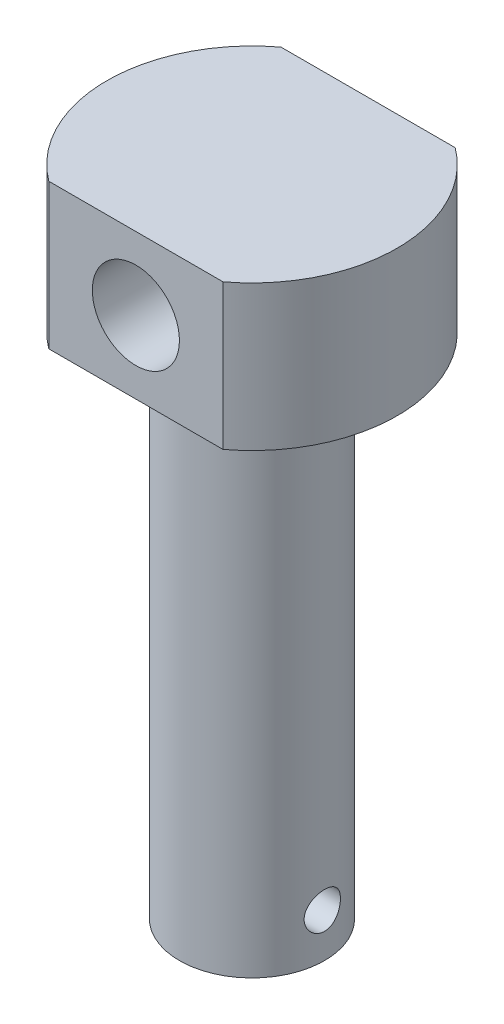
ISO-10303-21;
HEADER;
FILE_DESCRIPTION(('STEP AP214'),'2;1');
FILE_NAME('part.step','',(''),(''),'','','');
FILE_SCHEMA(('AUTOMOTIVE_DESIGN { 1 0 10303 214 1 1 1 1 }'));
ENDSEC;
DATA;
#1=APPLICATION_CONTEXT('core data for automotive mechanical design processes');
#2=APPLICATION_PROTOCOL_DEFINITION('international standard','automotive_design',2000,#1);
#3=PRODUCT_CONTEXT('',#1,'mechanical');
#4=PRODUCT('Part','Part','',(#3));
#5=PRODUCT_RELATED_PRODUCT_CATEGORY('part','',(#4));
#6=PRODUCT_DEFINITION_FORMATION('','',#4);
#7=PRODUCT_DEFINITION_CONTEXT('part definition',#1,'design');
#8=PRODUCT_DEFINITION('design','',#6,#7);
#9=PRODUCT_DEFINITION_SHAPE('','',#8);
#10=(LENGTH_UNIT() NAMED_UNIT(*) SI_UNIT(.MILLI.,.METRE.));
#11=(NAMED_UNIT(*) PLANE_ANGLE_UNIT() SI_UNIT($,.RADIAN.));
#12=(NAMED_UNIT(*) SI_UNIT($,.STERADIAN.) SOLID_ANGLE_UNIT());
#13=UNCERTAINTY_MEASURE_WITH_UNIT(LENGTH_MEASURE(1.E-05),#10,'distance_accuracy_value','');
#14=(GEOMETRIC_REPRESENTATION_CONTEXT(3) GLOBAL_UNCERTAINTY_ASSIGNED_CONTEXT((#13)) GLOBAL_UNIT_ASSIGNED_CONTEXT((#10,
#11,#12)) REPRESENTATION_CONTEXT('',''));
#15=CARTESIAN_POINT('',(0.,0.,0.));
#16=DIRECTION('',(0.,0.,1.));
#17=DIRECTION('',(1.,0.,0.));
#18=AXIS2_PLACEMENT_3D('',#15,#16,#17);
#19=CARTESIAN_POINT('',(0.,103.551163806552,0.));
#20=DIRECTION('',(0.,1.,0.));
#21=DIRECTION('',(-1.,0.,0.));
#22=AXIS2_PLACEMENT_3D('',#19,#20,#21);
#23=CYLINDRICAL_SURFACE('',#22,10.);
#24=CARTESIAN_POINT('',(0.,45.,0.));
#25=DIRECTION('',(0.,1.,0.));
#26=DIRECTION('',(-1.,0.,0.));
#27=AXIS2_PLACEMENT_3D('',#24,#25,#26);
#28=CIRCLE('',#27,10.);
#29=CARTESIAN_POINT('',(5.99999999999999,45.,8.00000000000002));
#30=VERTEX_POINT('',#29);
#31=CARTESIAN_POINT('',(5.99999999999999,45.,-8.));
#32=VERTEX_POINT('',#31);
#33=EDGE_CURVE('E123',#30,#32,#28,.T.);
#34=ORIENTED_EDGE('',*,*,#33,.F.);
#35=DIRECTION('',(0.,1.,0.));
#36=VECTOR('',#35,1.);
#37=CARTESIAN_POINT('',(5.99999999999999,0.,8.));
#38=LINE('',#37,#36);
#39=CARTESIAN_POINT('',(5.99999999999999,35.,8.));
#40=VERTEX_POINT('',#39);
#41=EDGE_CURVE('E54',#40,#30,#38,.T.);
#42=ORIENTED_EDGE('',*,*,#41,.F.);
#43=CARTESIAN_POINT('',(0.,35.,0.));
#44=DIRECTION('',(0.,1.,0.));
#45=DIRECTION('',(-1.,0.,0.));
#46=AXIS2_PLACEMENT_3D('',#43,#44,#45);
#47=CIRCLE('',#46,10.);
#48=CARTESIAN_POINT('',(5.99999999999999,35.,-8.));
#49=VERTEX_POINT('',#48);
#50=EDGE_CURVE('E127',#40,#49,#47,.T.);
#51=ORIENTED_EDGE('',*,*,#50,.T.);
#52=DIRECTION('',(0.,1.,0.));
#53=VECTOR('',#52,1.);
#54=CARTESIAN_POINT('',(5.99999999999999,0.,-8.));
#55=LINE('',#54,#53);
#56=EDGE_CURVE('E116',#49,#32,#55,.T.);
#57=ORIENTED_EDGE('',*,*,#56,.T.);
#58=EDGE_LOOP('',(#34,#42,#51,#57));
#59=FACE_BOUND('',#58,.T.);
#60=ADVANCED_FACE('F34',(#59),#23,.T.);
#61=CARTESIAN_POINT('',(0.,0.,0.));
#62=DIRECTION('',(0.,1.,0.));
#63=DIRECTION('',(-1.,0.,0.));
#64=AXIS2_PLACEMENT_3D('',#61,#62,#63);
#65=PLANE('',#64);
#66=CARTESIAN_POINT('',(0.,0.,0.));
#67=DIRECTION('',(0.,-1.,0.));
#68=DIRECTION('',(0.,0.,-1.));
#69=AXIS2_PLACEMENT_3D('',#66,#67,#68);
#70=CIRCLE('',#69,1.5);
#71=CARTESIAN_POINT('',(0.,0.,-1.5));
#72=VERTEX_POINT('',#71);
#73=EDGE_CURVE('E93',#72,#72,#70,.T.);
#74=ORIENTED_EDGE('',*,*,#73,.F.);
#75=EDGE_LOOP('',(#74));
#76=FACE_BOUND('',#75,.T.);
#77=CARTESIAN_POINT('',(0.,0.,0.));
#78=DIRECTION('',(0.,1.,0.));
#79=DIRECTION('',(-1.,0.,0.));
#80=AXIS2_PLACEMENT_3D('',#77,#78,#79);
#81=CIRCLE('',#80,5.);
#82=CARTESIAN_POINT('',(-4.99999999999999,0.,0.));
#83=VERTEX_POINT('',#82);
#84=EDGE_CURVE('E11',#83,#83,#81,.T.);
#85=ORIENTED_EDGE('',*,*,#84,.F.);
#86=EDGE_LOOP('',(#85));
#87=FACE_BOUND('',#86,.T.);
#88=ADVANCED_FACE('F36',(#76,#87),#65,.F.);
#89=CARTESIAN_POINT('',(0.,103.551163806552,0.));
#90=DIRECTION('',(0.,1.,0.));
#91=DIRECTION('',(-1.,0.,0.));
#92=AXIS2_PLACEMENT_3D('',#89,#90,#91);
#93=CYLINDRICAL_SURFACE('',#92,5.);
#94=CARTESIAN_POINT('',(4.84122918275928,3.,1.24999999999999));
#95=CARTESIAN_POINT('',(4.84123050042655,3.06902537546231,1.24999803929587));
#96=CARTESIAN_POINT('',(4.84272153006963,3.138072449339,1.24426312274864));
#97=CARTESIAN_POINT('',(4.8485093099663,3.27418378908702,1.22151156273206));
#98=CARTESIAN_POINT('',(4.85280769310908,3.34124687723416,1.20448835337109));
#99=CARTESIAN_POINT('',(4.86369362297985,3.47140176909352,1.15974559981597));
#100=CARTESIAN_POINT('',(4.8702782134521,3.53449857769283,1.13203986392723));
#101=CARTESIAN_POINT('',(4.8849909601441,3.65515542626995,1.0667605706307));
#102=CARTESIAN_POINT('',(4.89311918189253,3.71271523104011,1.02918659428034));
#103=CARTESIAN_POINT('',(4.91020358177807,3.8219308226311,0.944354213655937));
#104=CARTESIAN_POINT('',(4.91917298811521,3.87344680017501,0.896918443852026));
#105=CARTESIAN_POINT('',(4.93681437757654,3.96788069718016,0.794091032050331));
#106=CARTESIAN_POINT('',(4.94548633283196,4.01079781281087,0.73869864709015));
#107=CARTESIAN_POINT('',(4.96170207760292,4.08738773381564,0.620572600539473));
#108=CARTESIAN_POINT('',(4.96922843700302,4.12092319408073,0.55774728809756));
#109=CARTESIAN_POINT('',(4.98215405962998,4.17690482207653,0.427131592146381));
#110=CARTESIAN_POINT('',(4.98755363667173,4.19935262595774,0.359341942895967));
#111=CARTESIAN_POINT('',(4.99552379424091,4.23207391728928,0.222179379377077));
#112=CARTESIAN_POINT('',(4.99814946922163,4.24258482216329,0.152866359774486));
#113=CARTESIAN_POINT('',(5.00046797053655,4.25187918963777,0.0134144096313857));
#114=CARTESIAN_POINT('',(5.00016123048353,4.25066438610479,-0.0567243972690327));
#115=CARTESIAN_POINT('',(4.99669047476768,4.23671257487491,-0.194190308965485));
#116=CARTESIAN_POINT('',(4.99359001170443,4.22423183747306,-0.261545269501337));
#117=CARTESIAN_POINT('',(4.98495418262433,4.18851436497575,-0.39317280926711));
#118=CARTESIAN_POINT('',(4.97941868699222,4.16527705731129,-0.457445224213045));
#119=CARTESIAN_POINT('',(4.96643754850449,4.10849871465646,-0.581758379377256));
#120=CARTESIAN_POINT('',(4.95897509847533,4.07486647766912,-0.641755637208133));
#121=CARTESIAN_POINT('',(4.9429495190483,3.99832216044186,-0.755344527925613));
#122=CARTESIAN_POINT('',(4.93438619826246,3.95540846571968,-0.808935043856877));
#123=CARTESIAN_POINT('',(4.91681856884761,3.8601456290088,-0.90971754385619));
#124=CARTESIAN_POINT('',(4.90780859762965,3.8075725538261,-0.956697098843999));
#125=CARTESIAN_POINT('',(4.89057521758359,3.69520001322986,-1.04122046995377));
#126=CARTESIAN_POINT('',(4.88235184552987,3.63540021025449,-1.07876384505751));
#127=CARTESIAN_POINT('',(4.86760248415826,3.50985498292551,-1.14348516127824));
#128=CARTESIAN_POINT('',(4.86108491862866,3.44408213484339,-1.17061195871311));
#129=CARTESIAN_POINT('',(4.85059320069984,3.30870726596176,-1.21335702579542));
#130=CARTESIAN_POINT('',(4.8466185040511,3.23910606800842,-1.22897775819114));
#131=CARTESIAN_POINT('',(4.84177678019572,3.10002024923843,-1.24791481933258));
#132=CARTESIAN_POINT('',(4.8408304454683,3.03058110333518,-1.25154523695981));
#133=CARTESIAN_POINT('',(4.84193671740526,2.89208903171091,-1.24725849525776));
#134=CARTESIAN_POINT('',(4.84398904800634,2.82303607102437,-1.23934239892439));
#135=CARTESIAN_POINT('',(4.85078540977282,2.68844286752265,-1.21246273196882));
#136=CARTESIAN_POINT('',(4.85548485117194,2.62286363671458,-1.19368203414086));
#137=CARTESIAN_POINT('',(4.86700359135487,2.49578427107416,-1.1458090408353));
#138=CARTESIAN_POINT('',(4.87382314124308,2.43428462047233,-1.11671552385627));
#139=CARTESIAN_POINT('',(4.88898068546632,2.31577936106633,-1.04838533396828));
#140=CARTESIAN_POINT('',(4.89734584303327,2.25888557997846,-1.00896087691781));
#141=CARTESIAN_POINT('',(4.91458541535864,2.15240581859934,-0.921325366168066));
#142=CARTESIAN_POINT('',(4.92345991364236,2.10282104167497,-0.873112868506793));
#143=CARTESIAN_POINT('',(4.94098701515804,2.01109447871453,-0.767828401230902));
#144=CARTESIAN_POINT('',(4.94962851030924,1.9691699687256,-0.710564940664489));
#145=CARTESIAN_POINT('',(4.96548608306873,1.89553206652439,-0.589628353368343));
#146=CARTESIAN_POINT('',(4.97270223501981,1.8638181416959,-0.525955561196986));
#147=CARTESIAN_POINT('',(4.98485057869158,1.81177698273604,-0.394447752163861));
#148=CARTESIAN_POINT('',(4.98979915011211,1.79136785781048,-0.326646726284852));
#149=CARTESIAN_POINT('',(4.996926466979,1.7622698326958,-0.188437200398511));
#150=CARTESIAN_POINT('',(4.99910574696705,1.75357867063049,-0.118029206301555));
#151=CARTESIAN_POINT('',(5.00042711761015,1.74829051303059,0.0213544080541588));
#152=CARTESIAN_POINT('',(4.99964973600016,1.75137286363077,0.0903172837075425));
#153=CARTESIAN_POINT('',(4.99532370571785,1.76880978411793,0.226709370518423));
#154=CARTESIAN_POINT('',(4.9917751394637,1.78316401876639,0.294138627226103));
#155=CARTESIAN_POINT('',(4.98231791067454,1.82256527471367,0.425213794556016));
#156=CARTESIAN_POINT('',(4.97642205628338,1.84755431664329,0.488878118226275));
#157=CARTESIAN_POINT('',(4.96289111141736,1.90746322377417,0.611146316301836));
#158=CARTESIAN_POINT('',(4.95525580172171,1.94238434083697,0.66974955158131));
#159=CARTESIAN_POINT('',(4.93884062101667,2.02214404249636,0.781752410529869));
#160=CARTESIAN_POINT('',(4.9300377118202,2.06720017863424,0.834993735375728));
#161=CARTESIAN_POINT('',(4.91238311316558,2.16552856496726,0.933268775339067));
#162=CARTESIAN_POINT('',(4.90353141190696,2.21880289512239,0.978300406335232));
#163=CARTESIAN_POINT('',(4.88659344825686,2.33325176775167,1.05970253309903));
#164=CARTESIAN_POINT('',(4.87852454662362,2.39455515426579,1.09589577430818));
#165=CARTESIAN_POINT('',(4.86429944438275,2.52256936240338,1.15740862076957));
#166=CARTESIAN_POINT('',(4.85814185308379,2.58927620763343,1.18273613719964));
#167=CARTESIAN_POINT('',(4.84939885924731,2.7132212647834,1.21802816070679));
#168=CARTESIAN_POINT('',(4.84635828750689,2.76986645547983,1.22999146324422));
#169=CARTESIAN_POINT('',(4.84227298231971,2.88433608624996,1.24597786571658));
#170=CARTESIAN_POINT('',(4.84122807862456,2.94216042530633,1.25000164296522));
#171=CARTESIAN_POINT('',(4.84122918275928,3.,1.24999999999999));
#172=B_SPLINE_CURVE_WITH_KNOTS('',3,(#94,#95,#96,#97,#98,#99,#100,#101,#102,#103,#104,#105,#106,
#107,#108,#109,#110,#111,#112,#113,#114,#115,#116,#117,#118,#119,#120,#121,#122,#123,#124,#125,
#126,#127,#128,#129,#130,#131,#132,#133,#134,#135,#136,#137,#138,#139,#140,#141,#142,#143,#144,
#145,#146,#147,#148,#149,#150,#151,#152,#153,#154,#155,#156,#157,#158,#159,#160,#161,#162,#163,
#164,#165,#166,#167,#168,#169,#170,#171),.UNSPECIFIED.,.T.,.F.,(4,2,2,2,2,2,2,2,2,2,2,2,2,2,2,2,
2,2,2,2,2,2,2,2,2,2,2,2,2,2,2,2,2,2,2,2,2,2,4),(0.,0.206863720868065,0.413847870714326,
0.620565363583,0.827291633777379,1.03811977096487,1.24896760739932,1.46275748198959,
1.67651579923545,1.88594375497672,2.09534074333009,2.30009131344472,2.50485278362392,
2.71146437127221,2.91811192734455,3.13035233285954,3.34260265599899,3.555882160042,
3.76911600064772,3.97671787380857,4.18430063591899,4.38848702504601,4.59269760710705,
4.80091422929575,5.00916509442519,5.22262665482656,5.43607707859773,5.64796036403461,
5.85980274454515,6.06591723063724,6.27202558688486,6.47702438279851,6.68204902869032,
6.89198548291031,7.1019751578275,7.31588238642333,7.52963360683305,7.7029891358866,
7.87632987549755),.UNSPECIFIED.);
#173=CARTESIAN_POINT('',(4.84122918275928,3.,1.24999999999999));
#174=VERTEX_POINT('',#173);
#175=EDGE_CURVE('E99',#174,#174,#172,.T.);
#176=ORIENTED_EDGE('',*,*,#175,.T.);
#177=EDGE_LOOP('',(#176));
#178=FACE_BOUND('',#177,.T.);
#179=CARTESIAN_POINT('',(0.,35.,0.));
#180=DIRECTION('',(0.,1.,0.));
#181=DIRECTION('',(-1.,0.,0.));
#182=AXIS2_PLACEMENT_3D('',#179,#180,#181);
#183=CIRCLE('',#182,5.);
#184=CARTESIAN_POINT('',(-4.99999999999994,35.,0.));
#185=VERTEX_POINT('',#184);
#186=EDGE_CURVE('E47',#185,#185,#183,.T.);
#187=ORIENTED_EDGE('',*,*,#186,.F.);
#188=EDGE_LOOP('',(#187));
#189=FACE_BOUND('',#188,.T.);
#190=ORIENTED_EDGE('',*,*,#84,.T.);
#191=EDGE_LOOP('',(#190));
#192=FACE_BOUND('',#191,.T.);
#193=ADVANCED_FACE('F136',(#178,#189,#192),#93,.T.);
#194=CARTESIAN_POINT('',(5.00000000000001,35.,0.));
#195=DIRECTION('',(0.,1.,0.));
#196=DIRECTION('',(-1.,0.,0.));
#197=AXIS2_PLACEMENT_3D('',#194,#195,#196);
#198=PLANE('',#197);
#199=ORIENTED_EDGE('',*,*,#50,.F.);
#200=DIRECTION('',(-1.,0.,0.));
#201=VECTOR('',#200,1.);
#202=CARTESIAN_POINT('',(5.00000000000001,35.,8.));
#203=LINE('',#202,#201);
#204=CARTESIAN_POINT('',(-5.99999999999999,35.,8.00000000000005));
#205=VERTEX_POINT('',#204);
#206=EDGE_CURVE('E109',#40,#205,#203,.T.);
#207=ORIENTED_EDGE('',*,*,#206,.T.);
#208=CARTESIAN_POINT('',(-5.99999999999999,35.,-7.99999999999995));
#209=VERTEX_POINT('',#208);
#210=EDGE_CURVE('E128',#209,#205,#47,.T.);
#211=ORIENTED_EDGE('',*,*,#210,.F.);
#212=DIRECTION('',(1.,0.,0.));
#213=VECTOR('',#212,1.);
#214=CARTESIAN_POINT('',(5.,35.,-8.));
#215=LINE('',#214,#213);
#216=EDGE_CURVE('E119',#209,#49,#215,.T.);
#217=ORIENTED_EDGE('',*,*,#216,.T.);
#218=EDGE_LOOP('',(#199,#207,#211,#217));
#219=FACE_BOUND('',#218,.T.);
#220=ORIENTED_EDGE('',*,*,#186,.T.);
#221=EDGE_LOOP('',(#220));
#222=FACE_BOUND('',#221,.T.);
#223=ADVANCED_FACE('F134',(#219,#222),#198,.F.);
#224=ORIENTED_EDGE('',*,*,#210,.T.);
#225=DIRECTION('',(0.,1.,0.));
#226=VECTOR('',#225,1.);
#227=CARTESIAN_POINT('',(-5.99999999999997,0.,8.00000000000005));
#228=LINE('',#227,#226);
#229=CARTESIAN_POINT('',(-6.,45.,8.00000000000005));
#230=VERTEX_POINT('',#229);
#231=EDGE_CURVE('E107',#205,#230,#228,.T.);
#232=ORIENTED_EDGE('',*,*,#231,.T.);
#233=CARTESIAN_POINT('',(-6.,45.,-7.99999999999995));
#234=VERTEX_POINT('',#233);
#235=EDGE_CURVE('E124',#234,#230,#28,.T.);
#236=ORIENTED_EDGE('',*,*,#235,.F.);
#237=DIRECTION('',(0.,1.,0.));
#238=VECTOR('',#237,1.);
#239=CARTESIAN_POINT('',(-5.99999999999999,0.,-7.99999999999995));
#240=LINE('',#239,#238);
#241=EDGE_CURVE('E62',#209,#234,#240,.T.);
#242=ORIENTED_EDGE('',*,*,#241,.F.);
#243=EDGE_LOOP('',(#224,#232,#236,#242));
#244=FACE_BOUND('',#243,.T.);
#245=ADVANCED_FACE('F149',(#244),#23,.T.);
#246=CARTESIAN_POINT('',(10.,45.,0.));
#247=DIRECTION('',(0.,-1.,0.));
#248=DIRECTION('',(1.,0.,0.));
#249=AXIS2_PLACEMENT_3D('',#246,#247,#248);
#250=PLANE('',#249);
#251=ORIENTED_EDGE('',*,*,#235,.T.);
#252=DIRECTION('',(-1.,0.,0.));
#253=VECTOR('',#252,1.);
#254=CARTESIAN_POINT('',(-6.,45.,8.00000000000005));
#255=LINE('',#254,#253);
#256=EDGE_CURVE('E105',#30,#230,#255,.T.);
#257=ORIENTED_EDGE('',*,*,#256,.F.);
#258=ORIENTED_EDGE('',*,*,#33,.T.);
#259=DIRECTION('',(1.,0.,0.));
#260=VECTOR('',#259,1.);
#261=CARTESIAN_POINT('',(-6.,45.,-7.99999999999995));
#262=LINE('',#261,#260);
#263=EDGE_CURVE('E114',#234,#32,#262,.T.);
#264=ORIENTED_EDGE('',*,*,#263,.F.);
#265=EDGE_LOOP('',(#251,#257,#258,#264));
#266=FACE_BOUND('',#265,.T.);
#267=ADVANCED_FACE('F173',(#266),#250,.F.);
#268=CARTESIAN_POINT('',(-5.99999999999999,0.,-7.99999999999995));
#269=DIRECTION('',(0.,0.,1.));
#270=DIRECTION('',(1.,0.,0.));
#271=AXIS2_PLACEMENT_3D('',#268,#269,#270);
#272=PLANE('',#271);
#273=CARTESIAN_POINT('',(0.,40.,-8.));
#274=DIRECTION('',(0.,0.,1.));
#275=DIRECTION('',(1.,0.,0.));
#276=AXIS2_PLACEMENT_3D('',#273,#274,#275);
#277=CIRCLE('',#276,3.);
#278=CARTESIAN_POINT('',(3.,40.,-8.));
#279=VERTEX_POINT('',#278);
#280=EDGE_CURVE('E96',#279,#279,#277,.T.);
#281=ORIENTED_EDGE('',*,*,#280,.T.);
#282=EDGE_LOOP('',(#281));
#283=FACE_BOUND('',#282,.T.);
#284=ORIENTED_EDGE('',*,*,#241,.T.);
#285=ORIENTED_EDGE('',*,*,#263,.T.);
#286=ORIENTED_EDGE('',*,*,#56,.F.);
#287=ORIENTED_EDGE('',*,*,#216,.F.);
#288=EDGE_LOOP('',(#284,#285,#286,#287));
#289=FACE_BOUND('',#288,.T.);
#290=ADVANCED_FACE('F169',(#283,#289),#272,.F.);
#291=CARTESIAN_POINT('',(-5.99999999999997,0.,8.00000000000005));
#292=DIRECTION('',(0.,0.,-1.));
#293=DIRECTION('',(-1.,0.,0.));
#294=AXIS2_PLACEMENT_3D('',#291,#292,#293);
#295=PLANE('',#294);
#296=CARTESIAN_POINT('',(0.,40.,8.));
#297=DIRECTION('',(0.,0.,1.));
#298=DIRECTION('',(1.,0.,0.));
#299=AXIS2_PLACEMENT_3D('',#296,#297,#298);
#300=CIRCLE('',#299,2.99999999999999);
#301=CARTESIAN_POINT('',(2.99999999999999,40.,8.));
#302=VERTEX_POINT('',#301);
#303=EDGE_CURVE('E92',#302,#302,#300,.T.);
#304=ORIENTED_EDGE('',*,*,#303,.F.);
#305=EDGE_LOOP('',(#304));
#306=FACE_BOUND('',#305,.T.);
#307=ORIENTED_EDGE('',*,*,#41,.T.);
#308=ORIENTED_EDGE('',*,*,#256,.T.);
#309=ORIENTED_EDGE('',*,*,#231,.F.);
#310=ORIENTED_EDGE('',*,*,#206,.F.);
#311=EDGE_LOOP('',(#307,#308,#309,#310));
#312=FACE_BOUND('',#311,.T.);
#313=ADVANCED_FACE('F165',(#306,#312),#295,.F.);
#314=CARTESIAN_POINT('',(0.,40.,8.));
#315=DIRECTION('',(0.,0.,1.));
#316=DIRECTION('',(1.,0.,0.));
#317=AXIS2_PLACEMENT_3D('',#314,#315,#316);
#318=CYLINDRICAL_SURFACE('',#317,2.99999999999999);
#319=ORIENTED_EDGE('',*,*,#280,.F.);
#320=EDGE_LOOP('',(#319));
#321=FACE_BOUND('',#320,.T.);
#322=ORIENTED_EDGE('',*,*,#303,.T.);
#323=EDGE_LOOP('',(#322));
#324=FACE_BOUND('',#323,.T.);
#325=ADVANCED_FACE('F86',(#321,#324),#318,.F.);
#326=CARTESIAN_POINT('',(0.,9.99999999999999,0.));
#327=DIRECTION('',(0.,-1.,0.));
#328=DIRECTION('',(0.,0.,-1.));
#329=AXIS2_PLACEMENT_3D('',#326,#327,#328);
#330=CONICAL_SURFACE('',#329,1.5,1.02974425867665);
#331=CARTESIAN_POINT('',(0.,10.9012909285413,0.));
#332=VERTEX_POINT('',#331);
#333=VERTEX_LOOP('',#332);
#334=FACE_BOUND('',#333,.T.);
#335=CARTESIAN_POINT('',(0.,9.99999999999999,0.));
#336=DIRECTION('',(0.,-1.,0.));
#337=DIRECTION('',(0.,0.,-1.));
#338=AXIS2_PLACEMENT_3D('',#335,#336,#337);
#339=CIRCLE('',#338,1.5);
#340=CARTESIAN_POINT('',(0.,9.99999999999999,-1.5));
#341=VERTEX_POINT('',#340);
#342=EDGE_CURVE('E90',#341,#341,#339,.T.);
#343=ORIENTED_EDGE('',*,*,#342,.T.);
#344=EDGE_LOOP('',(#343));
#345=FACE_BOUND('',#344,.T.);
#346=ADVANCED_FACE('F82',(#334,#345),#330,.F.);
#347=CARTESIAN_POINT('',(0.,0.,0.));
#348=DIRECTION('',(0.,-1.,0.));
#349=DIRECTION('',(0.,0.,-1.));
#350=AXIS2_PLACEMENT_3D('',#347,#348,#349);
#351=CYLINDRICAL_SURFACE('',#350,1.5);
#352=CARTESIAN_POINT('',(0.82915619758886,3.,1.24999999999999));
#353=CARTESIAN_POINT('',(0.829171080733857,2.9558352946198,1.24999404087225));
#354=CARTESIAN_POINT('',(0.832762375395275,2.91161647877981,1.24763049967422));
#355=CARTESIAN_POINT('',(0.84639629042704,2.82461469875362,1.23841578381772));
#356=CARTESIAN_POINT('',(0.856461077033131,2.78183720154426,1.23154918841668));
#357=CARTESIAN_POINT('',(0.886166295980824,2.68244456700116,1.21043365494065));
#358=CARTESIAN_POINT('',(0.908006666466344,2.62689791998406,1.19435434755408));
#359=CARTESIAN_POINT('',(0.956683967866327,2.52041736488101,1.15573690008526));
#360=CARTESIAN_POINT('',(0.983536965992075,2.46949909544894,1.13317786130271));
#361=CARTESIAN_POINT('',(1.05182143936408,2.35024162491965,1.07081706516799));
#362=CARTESIAN_POINT('',(1.09442045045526,2.28424014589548,1.02781025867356));
#363=CARTESIAN_POINT('',(1.17868626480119,2.16108490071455,0.929991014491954));
#364=CARTESIAN_POINT('',(1.22035390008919,2.10392294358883,0.875189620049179));
#365=CARTESIAN_POINT('',(1.29053257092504,2.01070988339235,0.766663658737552));
#366=CARTESIAN_POINT('',(1.31995958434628,1.97275272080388,0.715176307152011));
#367=CARTESIAN_POINT('',(1.37388140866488,1.90432964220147,0.605134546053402));
#368=CARTESIAN_POINT('',(1.3983841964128,1.87385159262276,0.546591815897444));
#369=CARTESIAN_POINT('',(1.43686412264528,1.82644393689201,0.433965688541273));
#370=CARTESIAN_POINT('',(1.45192852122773,1.80808311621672,0.380860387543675));
#371=CARTESIAN_POINT('',(1.47630204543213,1.7785096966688,0.271416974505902));
#372=CARTESIAN_POINT('',(1.48561448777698,1.7672929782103,0.215080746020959));
#373=CARTESIAN_POINT('',(1.49774576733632,1.75269927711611,0.100453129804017));
#374=CARTESIAN_POINT('',(1.50053744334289,1.74935508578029,0.0421545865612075));
#375=CARTESIAN_POINT('',(1.4992907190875,1.75085112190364,-0.0742637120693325));
#376=CARTESIAN_POINT('',(1.49525247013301,1.75569116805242,-0.132383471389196));
#377=CARTESIAN_POINT('',(1.48120670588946,1.77260710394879,-0.242722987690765));
#378=CARTESIAN_POINT('',(1.47161807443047,1.78417547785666,-0.295076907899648));
#379=CARTESIAN_POINT('',(1.44750645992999,1.81347399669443,-0.396813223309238));
#380=CARTESIAN_POINT('',(1.43298276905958,1.83120502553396,-0.446195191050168));
#381=CARTESIAN_POINT('',(1.39845194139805,1.87379525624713,-0.545266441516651));
#382=CARTESIAN_POINT('',(1.37808191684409,1.89913460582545,-0.594620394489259));
#383=CARTESIAN_POINT('',(1.33372220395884,1.95519962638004,-0.688391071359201));
#384=CARTESIAN_POINT('',(1.30972926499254,1.98593013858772,-0.732803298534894));
#385=CARTESIAN_POINT('',(1.24725283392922,2.06772259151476,-0.836393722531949));
#386=CARTESIAN_POINT('',(1.20730441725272,2.12150339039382,-0.89254979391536));
#387=CARTESIAN_POINT('',(1.1255679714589,2.2376755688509,-0.993638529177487));
#388=CARTESIAN_POINT('',(1.08377681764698,2.30008198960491,-1.03855119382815));
#389=CARTESIAN_POINT('',(1.01367839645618,2.41558070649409,-1.10642031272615));
#390=CARTESIAN_POINT('',(0.984740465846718,2.4667374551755,-1.13203948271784));
#391=CARTESIAN_POINT('',(0.931069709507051,2.5739249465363,-1.17656863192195));
#392=CARTESIAN_POINT('',(0.906325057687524,2.62994128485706,-1.19549764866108));
#393=CARTESIAN_POINT('',(0.871882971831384,2.72791106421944,-1.22070568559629));
#394=CARTESIAN_POINT('',(0.859909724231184,2.76849961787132,-1.22909685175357));
#395=CARTESIAN_POINT('',(0.841388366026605,2.85148033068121,-1.24185130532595));
#396=CARTESIAN_POINT('',(0.834827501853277,2.89386800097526,-1.24622406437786));
#397=CARTESIAN_POINT('',(0.828296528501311,2.97971398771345,-1.25057759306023));
#398=CARTESIAN_POINT('',(0.82837400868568,3.02317780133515,-1.25052664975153));
#399=CARTESIAN_POINT('',(0.835225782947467,3.10935254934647,-1.24595802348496));
#400=CARTESIAN_POINT('',(0.842009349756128,3.15206235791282,-1.2414341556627));
#401=CARTESIAN_POINT('',(0.863399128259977,3.24609353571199,-1.22668003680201));
#402=CARTESIAN_POINT('',(0.879547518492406,3.29686791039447,-1.21529777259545));
#403=CARTESIAN_POINT('',(0.917232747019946,3.39481077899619,-1.18711365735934));
#404=CARTESIAN_POINT('',(0.938787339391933,3.44196671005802,-1.17029389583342));
#405=CARTESIAN_POINT('',(0.997868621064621,3.55861063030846,-1.12091579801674));
#406=CARTESIAN_POINT('',(1.03750412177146,3.62553547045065,-1.08484810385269));
#407=CARTESIAN_POINT('',(1.11795958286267,3.75142628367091,-1.00177028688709));
#408=CARTESIAN_POINT('',(1.15878118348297,3.81038052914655,-0.954744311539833));
#409=CARTESIAN_POINT('',(1.23882330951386,3.92123946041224,-0.848446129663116));
#410=CARTESIAN_POINT('',(1.27797673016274,3.97292677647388,-0.788892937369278));
#411=CARTESIAN_POINT('',(1.34974000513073,4.06542925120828,-0.658554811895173));
#412=CARTESIAN_POINT('',(1.38237166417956,4.10628079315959,-0.587808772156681));
#413=CARTESIAN_POINT('',(1.42822592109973,4.16297173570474,-0.461595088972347));
#414=CARTESIAN_POINT('',(1.44429507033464,4.1826119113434,-0.408859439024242));
#415=CARTESIAN_POINT('',(1.47077851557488,4.21481462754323,-0.299904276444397));
#416=CARTESIAN_POINT('',(1.4811972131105,4.22738267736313,-0.243687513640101));
#417=CARTESIAN_POINT('',(1.49556964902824,4.24468952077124,-0.128950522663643));
#418=CARTESIAN_POINT('',(1.4994922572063,4.24939061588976,-0.0704205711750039));
#419=CARTESIAN_POINT('',(1.50041455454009,4.25049755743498,0.0467748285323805));
#420=CARTESIAN_POINT('',(1.49741474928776,4.24690400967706,0.10544026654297));
#421=CARTESIAN_POINT('',(1.48523794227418,4.23225255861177,0.216739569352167));
#422=CARTESIAN_POINT('',(1.47652651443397,4.22175707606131,0.269501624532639));
#423=CARTESIAN_POINT('',(1.45403517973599,4.1944779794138,0.372221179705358));
#424=CARTESIAN_POINT('',(1.44025448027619,4.17769338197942,0.422178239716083));
#425=CARTESIAN_POINT('',(1.40732209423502,4.13719173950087,0.521919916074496));
#426=CARTESIAN_POINT('',(1.38785344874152,4.11306031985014,0.571429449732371));
#427=CARTESIAN_POINT('',(1.34519757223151,4.05939632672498,0.665676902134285));
#428=CARTESIAN_POINT('',(1.32200747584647,4.02985958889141,0.710411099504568));
#429=CARTESIAN_POINT('',(1.26133215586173,3.95098478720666,0.815004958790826));
#430=CARTESIAN_POINT('',(1.2223001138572,3.89891718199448,0.871916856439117));
#431=CARTESIAN_POINT('',(1.14196239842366,3.78623483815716,0.974772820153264));
#432=CARTESIAN_POINT('',(1.10065209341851,3.72560226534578,1.02069344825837));
#433=CARTESIAN_POINT('',(1.02874460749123,3.61023166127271,1.09255581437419));
#434=CARTESIAN_POINT('',(0.99776898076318,3.55707258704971,1.12067062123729));
#435=CARTESIAN_POINT('',(0.939989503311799,3.44537837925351,1.16954598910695));
#436=CARTESIAN_POINT('',(0.913174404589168,3.38685844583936,1.19032657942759));
#437=CARTESIAN_POINT('',(0.875984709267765,3.2850612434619,1.21778307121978));
#438=CARTESIAN_POINT('',(0.863119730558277,3.2433603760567,1.22685233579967));
#439=CARTESIAN_POINT('',(0.843069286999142,3.15798878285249,1.24072116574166));
#440=CARTESIAN_POINT('',(0.835861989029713,3.11432632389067,1.24553715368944));
#441=CARTESIAN_POINT('',(0.830150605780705,3.04692993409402,1.24934038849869));
#442=CARTESIAN_POINT('',(0.829148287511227,3.02347260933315,1.25000316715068));
#443=CARTESIAN_POINT('',(0.82915619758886,3.,1.24999999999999));
#444=B_SPLINE_CURVE_WITH_KNOTS('',3,(#352,#353,#354,#355,#356,#357,#358,#359,#360,#361,#362,
#363,#364,#365,#366,#367,#368,#369,#370,#371,#372,#373,#374,#375,#376,#377,#378,#379,#380,#381,
#382,#383,#384,#385,#386,#387,#388,#389,#390,#391,#392,#393,#394,#395,#396,#397,#398,#399,#400,
#401,#402,#403,#404,#405,#406,#407,#408,#409,#410,#411,#412,#413,#414,#415,#416,#417,#418,#419,
#420,#421,#422,#423,#424,#425,#426,#427,#428,#429,#430,#431,#432,#433,#434,#435,#436,#437,#438,
#439,#440,#441,#442,#443),.UNSPECIFIED.,.T.,.F.,(4,2,2,2,2,2,2,2,2,2,2,2,2,2,2,2,2,2,2,2,2,2,2,
2,2,2,2,2,2,2,2,2,2,2,2,2,2,2,2,2,2,2,2,2,2,4),(0.,0.132403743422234,0.265263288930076,
0.449655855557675,0.634649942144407,0.902012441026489,1.16912568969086,1.37958069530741,
1.58969198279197,1.76348814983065,1.93718400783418,2.11160208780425,2.28601630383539,
2.44872292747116,2.61145289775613,2.78810848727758,2.96492353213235,3.22582525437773,
3.48718781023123,3.67905555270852,3.8703728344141,3.99935306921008,4.12802850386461,
4.25762647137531,4.38740388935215,4.54993403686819,4.713005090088,4.96887834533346,
5.22512407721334,5.48788549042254,5.74975312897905,5.92462695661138,6.09936436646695,
6.27493674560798,6.45049630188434,6.61327577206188,6.776080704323,6.95068885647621,
7.12543210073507,7.38342809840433,7.6419694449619,7.84437004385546,8.04621354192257,
8.1794795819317,8.31222878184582,8.38259857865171),.UNSPECIFIED.);
#445=CARTESIAN_POINT('',(0.82915619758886,3.,1.24999999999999));
#446=VERTEX_POINT('',#445);
#447=EDGE_CURVE('E38',#446,#446,#444,.T.);
#448=ORIENTED_EDGE('',*,*,#447,.T.);
#449=EDGE_LOOP('',(#448));
#450=FACE_BOUND('',#449,.T.);
#451=ORIENTED_EDGE('',*,*,#342,.F.);
#452=EDGE_LOOP('',(#451));
#453=FACE_BOUND('',#452,.T.);
#454=ORIENTED_EDGE('',*,*,#73,.T.);
#455=EDGE_LOOP('',(#454));
#456=FACE_BOUND('',#455,.T.);
#457=ADVANCED_FACE('F85',(#450,#453,#456),#351,.F.);
#458=CARTESIAN_POINT('',(0.,3.,0.));
#459=DIRECTION('',(-1.,0.,0.));
#460=DIRECTION('',(0.,0.,1.));
#461=AXIS2_PLACEMENT_3D('',#458,#459,#460);
#462=CYLINDRICAL_SURFACE('',#461,1.24999999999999);
#463=ORIENTED_EDGE('',*,*,#447,.F.);
#464=EDGE_LOOP('',(#463));
#465=FACE_BOUND('',#464,.T.);
#466=ORIENTED_EDGE('',*,*,#175,.F.);
#467=EDGE_LOOP('',(#466));
#468=FACE_BOUND('',#467,.T.);
#469=ADVANCED_FACE('F153',(#465,#468),#462,.F.);
#470=CLOSED_SHELL('',(#60,#88,#193,#223,#245,#267,#290,#313,#325,#346,#457,#469));
#471=MANIFOLD_SOLID_BREP('B2',#470);
#472=ADVANCED_BREP_SHAPE_REPRESENTATION('',(#18,#471),#14);
#473=SHAPE_DEFINITION_REPRESENTATION(#9,#472);
ENDSEC;
END-ISO-10303-21;
